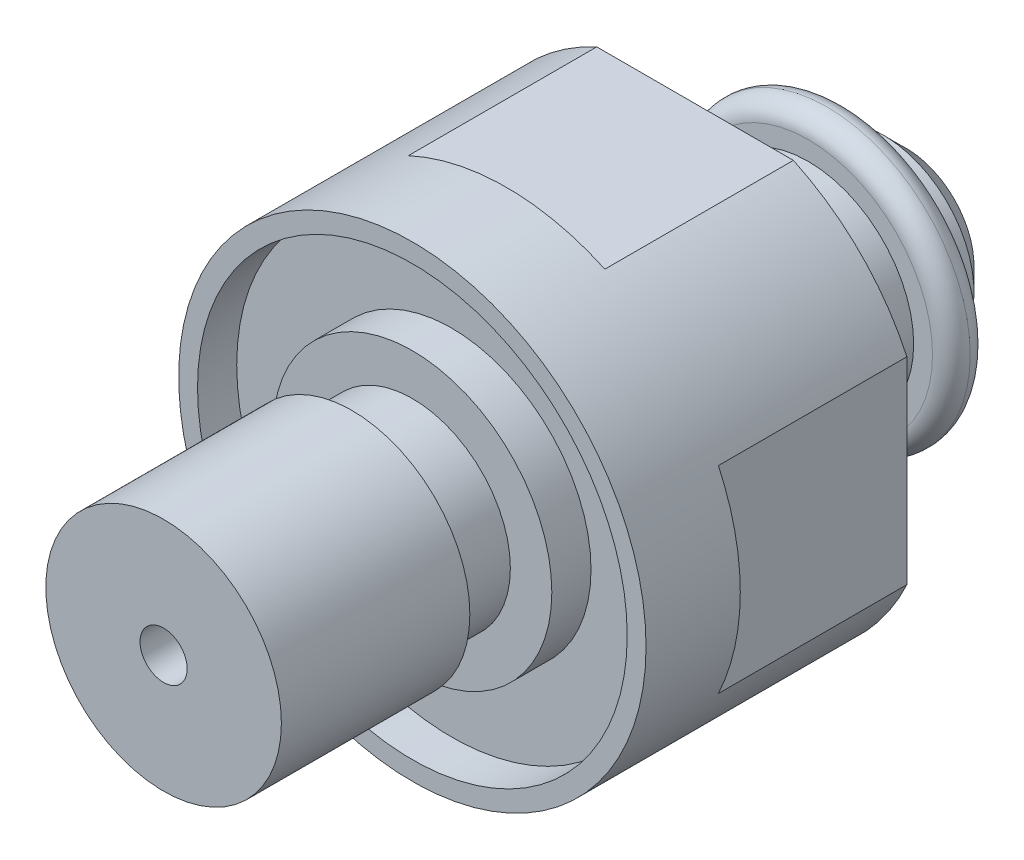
ISO-10303-21;
HEADER;
FILE_DESCRIPTION(('STEP AP214'),'2;1');
FILE_NAME('part.step','',(''),(''),'','','');
FILE_SCHEMA(('AUTOMOTIVE_DESIGN { 1 0 10303 214 1 1 1 1 }'));
ENDSEC;
DATA;
#1=APPLICATION_CONTEXT('core data for automotive mechanical design processes');
#2=APPLICATION_PROTOCOL_DEFINITION('international standard','automotive_design',2000,#1);
#3=PRODUCT_CONTEXT('',#1,'mechanical');
#4=PRODUCT('Part','Part','',(#3));
#5=PRODUCT_RELATED_PRODUCT_CATEGORY('part','',(#4));
#6=PRODUCT_DEFINITION_FORMATION('','',#4);
#7=PRODUCT_DEFINITION_CONTEXT('part definition',#1,'design');
#8=PRODUCT_DEFINITION('design','',#6,#7);
#9=PRODUCT_DEFINITION_SHAPE('','',#8);
#10=(LENGTH_UNIT() NAMED_UNIT(*) SI_UNIT(.MILLI.,.METRE.));
#11=(NAMED_UNIT(*) PLANE_ANGLE_UNIT() SI_UNIT($,.RADIAN.));
#12=(NAMED_UNIT(*) SI_UNIT($,.STERADIAN.) SOLID_ANGLE_UNIT());
#13=UNCERTAINTY_MEASURE_WITH_UNIT(LENGTH_MEASURE(1.E-05),#10,'distance_accuracy_value','');
#14=(GEOMETRIC_REPRESENTATION_CONTEXT(3) GLOBAL_UNCERTAINTY_ASSIGNED_CONTEXT((#13)) GLOBAL_UNIT_ASSIGNED_CONTEXT((#10,
#11,#12)) REPRESENTATION_CONTEXT('',''));
#15=CARTESIAN_POINT('',(0.,0.,0.));
#16=DIRECTION('',(0.,0.,1.));
#17=DIRECTION('',(1.,0.,0.));
#18=AXIS2_PLACEMENT_3D('',#15,#16,#17);
#19=CARTESIAN_POINT('',(0.,0.,-14.605));
#20=DIRECTION('',(0.,0.,-1.));
#21=DIRECTION('',(-1.,0.,0.));
#22=AXIS2_PLACEMENT_3D('',#19,#20,#21);
#23=PLANE('',#22);
#24=CARTESIAN_POINT('',(0.,0.,-14.605));
#25=DIRECTION('',(0.,0.,-1.));
#26=DIRECTION('',(-1.,0.,0.));
#27=AXIS2_PLACEMENT_3D('',#24,#25,#26);
#28=CIRCLE('',#27,4.191);
#29=CARTESIAN_POINT('',(-4.191,0.,-14.605));
#30=VERTEX_POINT('',#29);
#31=EDGE_CURVE('E437',#30,#30,#28,.T.);
#32=ORIENTED_EDGE('',*,*,#31,.T.);
#33=EDGE_LOOP('',(#32));
#34=FACE_BOUND('',#33,.T.);
#35=CARTESIAN_POINT('',(0.,0.,-14.605));
#36=DIRECTION('',(0.,0.,-1.));
#37=DIRECTION('',(-1.,0.,0.));
#38=AXIS2_PLACEMENT_3D('',#35,#36,#37);
#39=CIRCLE('',#38,3.048);
#40=CARTESIAN_POINT('',(-3.048,0.,-14.605));
#41=VERTEX_POINT('',#40);
#42=EDGE_CURVE('E169',#41,#41,#39,.T.);
#43=ORIENTED_EDGE('',*,*,#42,.F.);
#44=EDGE_LOOP('',(#43));
#45=FACE_BOUND('',#44,.T.);
#46=ADVANCED_FACE('F36',(#34,#45),#23,.T.);
#47=CARTESIAN_POINT('',(0.,0.,-9.525));
#48=DIRECTION('',(0.,0.,1.));
#49=DIRECTION('',(1.,0.,0.));
#50=AXIS2_PLACEMENT_3D('',#47,#48,#49);
#51=PLANE('',#50);
#52=CARTESIAN_POINT('',(0.,0.,-9.525));
#53=DIRECTION('',(0.,0.,1.));
#54=DIRECTION('',(1.,0.,0.));
#55=AXIS2_PLACEMENT_3D('',#52,#53,#54);
#56=CIRCLE('',#55,7.874);
#57=CARTESIAN_POINT('',(-7.1374,-3.32526649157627,-9.525));
#58=VERTEX_POINT('',#57);
#59=CARTESIAN_POINT('',(-3.31160262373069,-7.14375,-9.525));
#60=VERTEX_POINT('',#59);
#61=EDGE_CURVE('E114',#58,#60,#56,.T.);
#62=ORIENTED_EDGE('',*,*,#61,.F.);
#63=DIRECTION('',(0.,-1.,0.));
#64=VECTOR('',#63,1.);
#65=CARTESIAN_POINT('',(-7.1374,0.,-9.525));
#66=LINE('',#65,#64);
#67=CARTESIAN_POINT('',(-7.1374,3.32526649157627,-9.525));
#68=VERTEX_POINT('',#67);
#69=EDGE_CURVE('E101',#68,#58,#66,.T.);
#70=ORIENTED_EDGE('',*,*,#69,.F.);
#71=CARTESIAN_POINT('',(-3.31160262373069,7.14375,-9.525));
#72=VERTEX_POINT('',#71);
#73=EDGE_CURVE('E112',#72,#68,#56,.T.);
#74=ORIENTED_EDGE('',*,*,#73,.F.);
#75=DIRECTION('',(-1.,0.,0.));
#76=VECTOR('',#75,1.);
#77=CARTESIAN_POINT('',(10.16,7.14375,-9.525));
#78=LINE('',#77,#76);
#79=CARTESIAN_POINT('',(3.31160262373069,7.14375,-9.525));
#80=VERTEX_POINT('',#79);
#81=EDGE_CURVE('E183',#80,#72,#78,.T.);
#82=ORIENTED_EDGE('',*,*,#81,.F.);
#83=CARTESIAN_POINT('',(7.1374,3.32526649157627,-9.525));
#84=VERTEX_POINT('',#83);
#85=EDGE_CURVE('E127',#84,#80,#56,.T.);
#86=ORIENTED_EDGE('',*,*,#85,.F.);
#87=DIRECTION('',(0.,1.,0.));
#88=VECTOR('',#87,1.);
#89=CARTESIAN_POINT('',(7.1374,0.,-9.525));
#90=LINE('',#89,#88);
#91=CARTESIAN_POINT('',(7.1374,-3.32526649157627,-9.525));
#92=VERTEX_POINT('',#91);
#93=EDGE_CURVE('E190',#92,#84,#90,.T.);
#94=ORIENTED_EDGE('',*,*,#93,.F.);
#95=CARTESIAN_POINT('',(3.31160262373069,-7.14375,-9.525));
#96=VERTEX_POINT('',#95);
#97=EDGE_CURVE('E123',#96,#92,#56,.T.);
#98=ORIENTED_EDGE('',*,*,#97,.F.);
#99=DIRECTION('',(1.,0.,0.));
#100=VECTOR('',#99,1.);
#101=CARTESIAN_POINT('',(10.16,-7.14375,-9.525));
#102=LINE('',#101,#100);
#103=EDGE_CURVE('E187',#60,#96,#102,.T.);
#104=ORIENTED_EDGE('',*,*,#103,.F.);
#105=EDGE_LOOP('',(#62,#70,#74,#82,#86,#94,#98,#104));
#106=FACE_BOUND('',#105,.T.);
#107=CARTESIAN_POINT('',(0.,0.,-9.525));
#108=DIRECTION('',(0.,0.,1.));
#109=DIRECTION('',(1.,0.,0.));
#110=AXIS2_PLACEMENT_3D('',#107,#108,#109);
#111=CIRCLE('',#110,3.556);
#112=CARTESIAN_POINT('',(3.556,0.,-9.525));
#113=VERTEX_POINT('',#112);
#114=EDGE_CURVE('E121',#113,#113,#111,.F.);
#115=ORIENTED_EDGE('',*,*,#114,.F.);
#116=EDGE_LOOP('',(#115));
#117=FACE_BOUND('',#116,.T.);
#118=ADVANCED_FACE('F109',(#106,#117),#51,.F.);
#119=CARTESIAN_POINT('',(0.,0.,0.));
#120=DIRECTION('',(0.,0.,1.));
#121=DIRECTION('',(1.,0.,0.));
#122=AXIS2_PLACEMENT_3D('',#119,#120,#121);
#123=PLANE('',#122);
#124=CARTESIAN_POINT('',(0.,0.,0.));
#125=DIRECTION('',(0.,0.,1.));
#126=DIRECTION('',(1.,0.,0.));
#127=AXIS2_PLACEMENT_3D('',#124,#125,#126);
#128=CIRCLE('',#127,3.302);
#129=CARTESIAN_POINT('',(3.302,0.,0.));
#130=VERTEX_POINT('',#129);
#131=EDGE_CURVE('E143',#130,#130,#128,.T.);
#132=ORIENTED_EDGE('',*,*,#131,.F.);
#133=EDGE_LOOP('',(#132));
#134=FACE_BOUND('',#133,.T.);
#135=CARTESIAN_POINT('',(0.,0.,0.));
#136=DIRECTION('',(0.,0.,1.));
#137=DIRECTION('',(1.,0.,0.));
#138=AXIS2_PLACEMENT_3D('',#135,#136,#137);
#139=CIRCLE('',#138,4.699);
#140=CARTESIAN_POINT('',(4.699,0.,0.));
#141=VERTEX_POINT('',#140);
#142=EDGE_CURVE('E163',#141,#141,#139,.T.);
#143=ORIENTED_EDGE('',*,*,#142,.T.);
#144=EDGE_LOOP('',(#143));
#145=FACE_BOUND('',#144,.T.);
#146=ADVANCED_FACE('F234',(#134,#145),#123,.T.);
#147=CARTESIAN_POINT('',(0.,0.,2.032));
#148=DIRECTION('',(0.,0.,-1.));
#149=DIRECTION('',(-1.,0.,0.));
#150=AXIS2_PLACEMENT_3D('',#147,#148,#149);
#151=CYLINDRICAL_SURFACE('',#150,3.302);
#152=CARTESIAN_POINT('',(0.,0.,2.032));
#153=DIRECTION('',(0.,0.,1.));
#154=DIRECTION('',(1.,0.,0.));
#155=AXIS2_PLACEMENT_3D('',#152,#153,#154);
#156=CIRCLE('',#155,3.302);
#157=CARTESIAN_POINT('',(3.302,0.,2.032));
#158=VERTEX_POINT('',#157);
#159=EDGE_CURVE('E139',#158,#158,#156,.T.);
#160=ORIENTED_EDGE('',*,*,#159,.F.);
#161=EDGE_LOOP('',(#160));
#162=FACE_BOUND('',#161,.T.);
#163=ORIENTED_EDGE('',*,*,#131,.T.);
#164=EDGE_LOOP('',(#163));
#165=FACE_BOUND('',#164,.T.);
#166=ADVANCED_FACE('F263',(#162,#165),#151,.T.);
#167=CARTESIAN_POINT('',(0.,0.,2.032));
#168=DIRECTION('',(0.,0.,1.));
#169=DIRECTION('',(1.,0.,0.));
#170=AXIS2_PLACEMENT_3D('',#167,#168,#169);
#171=PLANE('',#170);
#172=CARTESIAN_POINT('',(0.,0.,2.032));
#173=DIRECTION('',(0.,0.,1.));
#174=DIRECTION('',(1.,0.,0.));
#175=AXIS2_PLACEMENT_3D('',#172,#173,#174);
#176=CIRCLE('',#175,3.96875);
#177=CARTESIAN_POINT('',(3.96875,0.,2.032));
#178=VERTEX_POINT('',#177);
#179=EDGE_CURVE('E151',#178,#178,#176,.T.);
#180=ORIENTED_EDGE('',*,*,#179,.F.);
#181=EDGE_LOOP('',(#180));
#182=FACE_BOUND('',#181,.T.);
#183=ORIENTED_EDGE('',*,*,#159,.T.);
#184=EDGE_LOOP('',(#183));
#185=FACE_BOUND('',#184,.T.);
#186=ADVANCED_FACE('F259',(#182,#185),#171,.F.);
#187=CARTESIAN_POINT('',(0.,0.,8.382));
#188=DIRECTION('',(0.,0.,-1.));
#189=DIRECTION('',(-1.,0.,0.));
#190=AXIS2_PLACEMENT_3D('',#187,#188,#189);
#191=CYLINDRICAL_SURFACE('',#190,3.96875);
#192=CARTESIAN_POINT('',(0.,0.,8.382));
#193=DIRECTION('',(0.,0.,1.));
#194=DIRECTION('',(1.,0.,0.));
#195=AXIS2_PLACEMENT_3D('',#192,#193,#194);
#196=CIRCLE('',#195,3.96875);
#197=CARTESIAN_POINT('',(3.96875,0.,8.382));
#198=VERTEX_POINT('',#197);
#199=EDGE_CURVE('E148',#198,#198,#196,.T.);
#200=ORIENTED_EDGE('',*,*,#199,.F.);
#201=EDGE_LOOP('',(#200));
#202=FACE_BOUND('',#201,.T.);
#203=ORIENTED_EDGE('',*,*,#179,.T.);
#204=EDGE_LOOP('',(#203));
#205=FACE_BOUND('',#204,.T.);
#206=ADVANCED_FACE('F262',(#202,#205),#191,.T.);
#207=CARTESIAN_POINT('',(0.,0.,8.382));
#208=DIRECTION('',(0.,0.,1.));
#209=DIRECTION('',(1.,0.,0.));
#210=AXIS2_PLACEMENT_3D('',#207,#208,#209);
#211=PLANE('',#210);
#212=CARTESIAN_POINT('',(0.,0.,8.382));
#213=DIRECTION('',(0.,0.,-1.));
#214=DIRECTION('',(-1.,0.,0.));
#215=AXIS2_PLACEMENT_3D('',#212,#213,#214);
#216=CIRCLE('',#215,0.79375);
#217=CARTESIAN_POINT('',(-0.79375,0.,8.382));
#218=VERTEX_POINT('',#217);
#219=EDGE_CURVE('E172',#218,#218,#216,.T.);
#220=ORIENTED_EDGE('',*,*,#219,.T.);
#221=EDGE_LOOP('',(#220));
#222=FACE_BOUND('',#221,.T.);
#223=ORIENTED_EDGE('',*,*,#199,.T.);
#224=EDGE_LOOP('',(#223));
#225=FACE_BOUND('',#224,.T.);
#226=ADVANCED_FACE('F257',(#222,#225),#211,.T.);
#227=CARTESIAN_POINT('',(0.,0.,-1.3208));
#228=DIRECTION('',(0.,0.,1.));
#229=DIRECTION('',(1.,0.,0.));
#230=AXIS2_PLACEMENT_3D('',#227,#228,#229);
#231=CYLINDRICAL_SURFACE('',#230,7.239);
#232=CARTESIAN_POINT('',(0.,0.,-1.3208));
#233=DIRECTION('',(0.,0.,1.));
#234=DIRECTION('',(1.,0.,0.));
#235=AXIS2_PLACEMENT_3D('',#232,#233,#234);
#236=CIRCLE('',#235,7.239);
#237=CARTESIAN_POINT('',(7.239,0.,-1.3208));
#238=VERTEX_POINT('',#237);
#239=EDGE_CURVE('E154',#238,#238,#236,.T.);
#240=ORIENTED_EDGE('',*,*,#239,.F.);
#241=EDGE_LOOP('',(#240));
#242=FACE_BOUND('',#241,.T.);
#243=CARTESIAN_POINT('',(0.,0.,0.));
#244=DIRECTION('',(0.,0.,1.));
#245=DIRECTION('',(1.,0.,0.));
#246=AXIS2_PLACEMENT_3D('',#243,#244,#245);
#247=CIRCLE('',#246,7.239);
#248=CARTESIAN_POINT('',(7.239,0.,0.));
#249=VERTEX_POINT('',#248);
#250=EDGE_CURVE('E157',#249,#249,#247,.T.);
#251=ORIENTED_EDGE('',*,*,#250,.T.);
#252=EDGE_LOOP('',(#251));
#253=FACE_BOUND('',#252,.T.);
#254=ADVANCED_FACE('F253',(#242,#253),#231,.F.);
#255=CARTESIAN_POINT('',(0.,0.,-1.3208));
#256=DIRECTION('',(0.,0.,1.));
#257=DIRECTION('',(1.,0.,0.));
#258=AXIS2_PLACEMENT_3D('',#255,#256,#257);
#259=PLANE('',#258);
#260=CARTESIAN_POINT('',(0.,0.,-1.3208));
#261=DIRECTION('',(0.,0.,1.));
#262=DIRECTION('',(1.,0.,0.));
#263=AXIS2_PLACEMENT_3D('',#260,#261,#262);
#264=CIRCLE('',#263,4.699);
#265=CARTESIAN_POINT('',(4.699,0.,-1.3208));
#266=VERTEX_POINT('',#265);
#267=EDGE_CURVE('E160',#266,#266,#264,.T.);
#268=ORIENTED_EDGE('',*,*,#267,.F.);
#269=EDGE_LOOP('',(#268));
#270=FACE_BOUND('',#269,.T.);
#271=ORIENTED_EDGE('',*,*,#239,.T.);
#272=EDGE_LOOP('',(#271));
#273=FACE_BOUND('',#272,.T.);
#274=ADVANCED_FACE('F249',(#270,#273),#259,.T.);
#275=CARTESIAN_POINT('',(0.,0.,-1.3208));
#276=DIRECTION('',(0.,0.,1.));
#277=DIRECTION('',(1.,0.,0.));
#278=AXIS2_PLACEMENT_3D('',#275,#276,#277);
#279=CYLINDRICAL_SURFACE('',#278,4.699);
#280=ORIENTED_EDGE('',*,*,#267,.T.);
#281=EDGE_LOOP('',(#280));
#282=FACE_BOUND('',#281,.T.);
#283=ORIENTED_EDGE('',*,*,#142,.F.);
#284=EDGE_LOOP('',(#283));
#285=FACE_BOUND('',#284,.T.);
#286=ADVANCED_FACE('F246',(#282,#285),#279,.T.);
#287=CARTESIAN_POINT('',(0.,0.,-9.525));
#288=DIRECTION('',(0.,0.,1.));
#289=DIRECTION('',(1.,0.,0.));
#290=AXIS2_PLACEMENT_3D('',#287,#288,#289);
#291=CYLINDRICAL_SURFACE('',#290,7.874);
#292=DIRECTION('',(0.,0.,1.));
#293=VECTOR('',#292,1.);
#294=CARTESIAN_POINT('',(-7.1374,3.32526649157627,-9.525));
#295=LINE('',#294,#293);
#296=CARTESIAN_POINT('',(-7.1374,3.32526649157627,-3.175));
#297=VERTEX_POINT('',#296);
#298=EDGE_CURVE('E11',#297,#68,#295,.F.);
#299=ORIENTED_EDGE('',*,*,#298,.F.);
#300=CARTESIAN_POINT('',(0.,0.,-3.175));
#301=DIRECTION('',(0.,0.,1.));
#302=DIRECTION('',(1.,0.,0.));
#303=AXIS2_PLACEMENT_3D('',#300,#301,#302);
#304=CIRCLE('',#303,7.874);
#305=CARTESIAN_POINT('',(-7.1374,-3.32526649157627,-3.175));
#306=VERTEX_POINT('',#305);
#307=EDGE_CURVE('E219',#306,#297,#304,.F.);
#308=ORIENTED_EDGE('',*,*,#307,.F.);
#309=DIRECTION('',(0.,0.,1.));
#310=VECTOR('',#309,1.);
#311=CARTESIAN_POINT('',(-7.1374,-3.32526649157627,-9.525));
#312=LINE('',#311,#310);
#313=EDGE_CURVE('E44',#58,#306,#312,.T.);
#314=ORIENTED_EDGE('',*,*,#313,.F.);
#315=ORIENTED_EDGE('',*,*,#61,.T.);
#316=DIRECTION('',(0.,0.,1.));
#317=VECTOR('',#316,1.);
#318=CARTESIAN_POINT('',(-3.31160262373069,-7.14375,-9.525));
#319=LINE('',#318,#317);
#320=CARTESIAN_POINT('',(-3.31160262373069,-7.14375,-3.175));
#321=VERTEX_POINT('',#320);
#322=EDGE_CURVE('E214',#321,#60,#319,.F.);
#323=ORIENTED_EDGE('',*,*,#322,.F.);
#324=CARTESIAN_POINT('',(0.,0.,-3.175));
#325=DIRECTION('',(0.,0.,1.));
#326=DIRECTION('',(1.,0.,0.));
#327=AXIS2_PLACEMENT_3D('',#324,#325,#326);
#328=CIRCLE('',#327,7.874);
#329=CARTESIAN_POINT('',(3.31160262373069,-7.14375,-3.175));
#330=VERTEX_POINT('',#329);
#331=EDGE_CURVE('E204',#330,#321,#328,.F.);
#332=ORIENTED_EDGE('',*,*,#331,.F.);
#333=DIRECTION('',(0.,0.,1.));
#334=VECTOR('',#333,1.);
#335=CARTESIAN_POINT('',(3.31160262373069,-7.14375,-9.525));
#336=LINE('',#335,#334);
#337=EDGE_CURVE('E206',#96,#330,#336,.T.);
#338=ORIENTED_EDGE('',*,*,#337,.F.);
#339=ORIENTED_EDGE('',*,*,#97,.T.);
#340=DIRECTION('',(0.,0.,1.));
#341=VECTOR('',#340,1.);
#342=CARTESIAN_POINT('',(7.1374,-3.32526649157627,-9.525));
#343=LINE('',#342,#341);
#344=CARTESIAN_POINT('',(7.1374,-3.32526649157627,-3.175));
#345=VERTEX_POINT('',#344);
#346=EDGE_CURVE('E197',#345,#92,#343,.F.);
#347=ORIENTED_EDGE('',*,*,#346,.F.);
#348=CARTESIAN_POINT('',(0.,0.,-3.175));
#349=DIRECTION('',(0.,0.,-1.));
#350=DIRECTION('',(-1.,0.,0.));
#351=AXIS2_PLACEMENT_3D('',#348,#349,#350);
#352=CIRCLE('',#351,7.874);
#353=CARTESIAN_POINT('',(7.1374,3.32526649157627,-3.175));
#354=VERTEX_POINT('',#353);
#355=EDGE_CURVE('E198',#345,#354,#352,.F.);
#356=ORIENTED_EDGE('',*,*,#355,.T.);
#357=DIRECTION('',(0.,0.,1.));
#358=VECTOR('',#357,1.);
#359=CARTESIAN_POINT('',(7.1374,3.32526649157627,-9.525));
#360=LINE('',#359,#358);
#361=EDGE_CURVE('E195',#84,#354,#360,.T.);
#362=ORIENTED_EDGE('',*,*,#361,.F.);
#363=ORIENTED_EDGE('',*,*,#85,.T.);
#364=DIRECTION('',(0.,0.,1.));
#365=VECTOR('',#364,1.);
#366=CARTESIAN_POINT('',(3.31160262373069,7.14375,-9.525));
#367=LINE('',#366,#365);
#368=CARTESIAN_POINT('',(3.31160262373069,7.14375,-3.175));
#369=VERTEX_POINT('',#368);
#370=EDGE_CURVE('E203',#369,#80,#367,.F.);
#371=ORIENTED_EDGE('',*,*,#370,.F.);
#372=CARTESIAN_POINT('',(0.,0.,-3.175));
#373=DIRECTION('',(0.,0.,-1.));
#374=DIRECTION('',(-1.,0.,0.));
#375=AXIS2_PLACEMENT_3D('',#372,#373,#374);
#376=CIRCLE('',#375,7.874);
#377=CARTESIAN_POINT('',(-3.31160262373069,7.14375,-3.175));
#378=VERTEX_POINT('',#377);
#379=EDGE_CURVE('E208',#369,#378,#376,.F.);
#380=ORIENTED_EDGE('',*,*,#379,.T.);
#381=DIRECTION('',(0.,0.,1.));
#382=VECTOR('',#381,1.);
#383=CARTESIAN_POINT('',(-3.31160262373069,7.14375,-9.525));
#384=LINE('',#383,#382);
#385=EDGE_CURVE('E120',#72,#378,#384,.T.);
#386=ORIENTED_EDGE('',*,*,#385,.F.);
#387=ORIENTED_EDGE('',*,*,#73,.T.);
#388=EDGE_LOOP('',(#299,#308,#314,#315,#323,#332,#338,#339,#347,#356,#362,#363,#371,#380,#386,#387));
#389=FACE_BOUND('',#388,.T.);
#390=CARTESIAN_POINT('',(0.,0.,0.));
#391=DIRECTION('',(0.,0.,1.));
#392=DIRECTION('',(1.,0.,0.));
#393=AXIS2_PLACEMENT_3D('',#390,#391,#392);
#394=CIRCLE('',#393,7.874);
#395=CARTESIAN_POINT('',(7.874,0.,0.));
#396=VERTEX_POINT('',#395);
#397=EDGE_CURVE('E133',#396,#396,#394,.T.);
#398=ORIENTED_EDGE('',*,*,#397,.F.);
#399=EDGE_LOOP('',(#398));
#400=FACE_BOUND('',#399,.T.);
#401=ADVANCED_FACE('F38',(#389,#400),#291,.T.);
#402=ORIENTED_EDGE('',*,*,#250,.F.);
#403=EDGE_LOOP('',(#402));
#404=FACE_BOUND('',#403,.T.);
#405=ORIENTED_EDGE('',*,*,#397,.T.);
#406=EDGE_LOOP('',(#405));
#407=FACE_BOUND('',#406,.T.);
#408=ADVANCED_FACE('F244',(#404,#407),#123,.T.);
#409=CARTESIAN_POINT('',(0.,0.,-13.335));
#410=DIRECTION('',(0.,0.,1.));
#411=DIRECTION('',(1.,0.,0.));
#412=AXIS2_PLACEMENT_3D('',#409,#410,#411);
#413=CYLINDRICAL_SURFACE('',#412,3.556);
#414=CARTESIAN_POINT('',(0.,0.,-13.335));
#415=DIRECTION('',(0.,0.,-1.));
#416=DIRECTION('',(-1.,0.,0.));
#417=AXIS2_PLACEMENT_3D('',#414,#415,#416);
#418=CIRCLE('',#417,3.556);
#419=CARTESIAN_POINT('',(3.556,0.,-13.335));
#420=VERTEX_POINT('',#419);
#421=EDGE_CURVE('E166',#420,#420,#418,.T.);
#422=CARTESIAN_POINT('',(3.556,0.,-13.335));
#423=CARTESIAN_POINT('',(3.556,0.,-13.2953125));
#424=CARTESIAN_POINT('',(3.556,0.,-13.255625));
#425=CARTESIAN_POINT('',(3.556,0.,-13.17625));
#426=CARTESIAN_POINT('',(3.556,0.,-13.1365625));
#427=CARTESIAN_POINT('',(3.556,0.,-13.0571875));
#428=CARTESIAN_POINT('',(3.556,0.,-13.0175));
#429=CARTESIAN_POINT('',(3.556,0.,-12.938125));
#430=CARTESIAN_POINT('',(3.556,0.,-12.8984375));
#431=CARTESIAN_POINT('',(3.556,0.,-12.8190625));
#432=CARTESIAN_POINT('',(3.556,0.,-12.779375));
#433=CARTESIAN_POINT('',(3.556,0.,-12.7));
#434=CARTESIAN_POINT('',(3.556,0.,-12.6603125));
#435=CARTESIAN_POINT('',(3.556,0.,-12.5809375));
#436=CARTESIAN_POINT('',(3.556,0.,-12.54125));
#437=CARTESIAN_POINT('',(3.556,0.,-12.461875));
#438=CARTESIAN_POINT('',(3.556,0.,-12.4221875));
#439=CARTESIAN_POINT('',(3.556,0.,-12.3428125));
#440=CARTESIAN_POINT('',(3.556,0.,-12.303125));
#441=CARTESIAN_POINT('',(3.556,0.,-12.22375));
#442=CARTESIAN_POINT('',(3.556,0.,-12.1840625));
#443=CARTESIAN_POINT('',(3.556,0.,-12.1046875));
#444=CARTESIAN_POINT('',(3.556,0.,-12.065));
#445=CARTESIAN_POINT('',(3.556,0.,-11.985625));
#446=CARTESIAN_POINT('',(3.556,0.,-11.9459375));
#447=CARTESIAN_POINT('',(3.556,0.,-11.8665625));
#448=CARTESIAN_POINT('',(3.556,0.,-11.826875));
#449=CARTESIAN_POINT('',(3.556,0.,-11.7475));
#450=CARTESIAN_POINT('',(3.556,0.,-11.7078125));
#451=CARTESIAN_POINT('',(3.556,0.,-11.6284375));
#452=CARTESIAN_POINT('',(3.556,0.,-11.58875));
#453=CARTESIAN_POINT('',(3.556,0.,-11.509375));
#454=CARTESIAN_POINT('',(3.556,0.,-11.4696875));
#455=CARTESIAN_POINT('',(3.556,0.,-11.3903125));
#456=CARTESIAN_POINT('',(3.556,0.,-11.350625));
#457=CARTESIAN_POINT('',(3.556,0.,-11.27125));
#458=CARTESIAN_POINT('',(3.556,0.,-11.2315625));
#459=CARTESIAN_POINT('',(3.556,0.,-11.1521875));
#460=CARTESIAN_POINT('',(3.556,0.,-11.1125));
#461=CARTESIAN_POINT('',(3.556,0.,-11.033125));
#462=CARTESIAN_POINT('',(3.556,0.,-10.9934375));
#463=CARTESIAN_POINT('',(3.556,0.,-10.9140625));
#464=CARTESIAN_POINT('',(3.556,0.,-10.874375));
#465=CARTESIAN_POINT('',(3.556,0.,-10.795));
#466=CARTESIAN_POINT('',(3.556,0.,-10.7553125));
#467=CARTESIAN_POINT('',(3.556,0.,-10.6759375));
#468=CARTESIAN_POINT('',(3.556,0.,-10.63625));
#469=CARTESIAN_POINT('',(3.556,0.,-10.556875));
#470=CARTESIAN_POINT('',(3.556,0.,-10.5171875));
#471=CARTESIAN_POINT('',(3.556,0.,-10.4378125));
#472=CARTESIAN_POINT('',(3.556,0.,-10.398125));
#473=CARTESIAN_POINT('',(3.556,0.,-10.31875));
#474=CARTESIAN_POINT('',(3.556,0.,-10.2790625));
#475=CARTESIAN_POINT('',(3.556,0.,-10.1996875));
#476=CARTESIAN_POINT('',(3.556,0.,-10.16));
#477=CARTESIAN_POINT('',(3.556,0.,-10.080625));
#478=CARTESIAN_POINT('',(3.556,0.,-10.0409375));
#479=CARTESIAN_POINT('',(3.556,0.,-9.9615625));
#480=CARTESIAN_POINT('',(3.556,0.,-9.921875));
#481=CARTESIAN_POINT('',(3.556,0.,-9.8425));
#482=CARTESIAN_POINT('',(3.556,0.,-9.8028125));
#483=CARTESIAN_POINT('',(3.556,0.,-9.7234375));
#484=CARTESIAN_POINT('',(3.556,0.,-9.68375));
#485=CARTESIAN_POINT('',(3.556,0.,-9.604375));
#486=CARTESIAN_POINT('',(3.556,0.,-9.5646875));
#487=CARTESIAN_POINT('',(3.556,0.,-9.525));
#488=B_SPLINE_CURVE_WITH_KNOTS('',3,(#422,#423,#424,#425,#426,#427,#428,#429,#430,#431,#432,
#433,#434,#435,#436,#437,#438,#439,#440,#441,#442,#443,#444,#445,#446,#447,#448,#449,#450,#451,
#452,#453,#454,#455,#456,#457,#458,#459,#460,#461,#462,#463,#464,#465,#466,#467,#468,#469,#470,
#471,#472,#473,#474,#475,#476,#477,#478,#479,#480,#481,#482,#483,#484,#485,#486,#487),
.UNSPECIFIED.,.F.,.F.,(4,2,2,2,2,2,2,2,2,2,2,2,2,2,2,2,2,2,2,2,2,2,2,2,2,2,2,2,2,2,2,2,4),(0.,
0.119062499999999,0.238124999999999,0.357187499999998,0.476249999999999,0.595312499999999,
0.714374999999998,0.833437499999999,0.952499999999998,1.0715625,1.190625,1.3096875,1.42875,
1.5478125,1.666875,1.7859375,1.905,2.0240625,2.143125,2.2621875,2.38125,2.5003125,2.619375,
2.7384375,2.8575,2.9765625,3.095625,3.2146875,3.33375,3.4528125,3.571875,3.6909375,3.81),.UNSPECIFIED.);
#489=EDGE_CURVE('BSEAM241',#420,#113,#488,.T.);
#490=ORIENTED_EDGE('',*,*,#421,.F.);
#491=ORIENTED_EDGE('',*,*,#114,.T.);
#492=ORIENTED_EDGE('',*,*,#489,.T.);
#493=ORIENTED_EDGE('',*,*,#489,.F.);
#494=EDGE_LOOP('',(#490,#492,#491,#493));
#495=FACE_BOUND('',#494,.T.);
#496=ADVANCED_FACE('F241',(#495),#413,.T.);
#497=CARTESIAN_POINT('',(0.,0.,-13.335));
#498=DIRECTION('',(0.,0.,-1.));
#499=DIRECTION('',(-1.,0.,0.));
#500=AXIS2_PLACEMENT_3D('',#497,#498,#499);
#501=PLANE('',#500);
#502=CARTESIAN_POINT('',(0.,0.,-13.335));
#503=DIRECTION('',(0.,0.,-1.));
#504=DIRECTION('',(-1.,0.,0.));
#505=AXIS2_PLACEMENT_3D('',#502,#503,#504);
#506=CIRCLE('',#505,4.191);
#507=CARTESIAN_POINT('',(-4.191,0.,-13.335));
#508=VERTEX_POINT('',#507);
#509=EDGE_CURVE('E125',#508,#508,#506,.F.);
#510=ORIENTED_EDGE('',*,*,#509,.T.);
#511=EDGE_LOOP('',(#510));
#512=FACE_BOUND('',#511,.T.);
#513=ORIENTED_EDGE('',*,*,#421,.T.);
#514=EDGE_LOOP('',(#513));
#515=FACE_BOUND('',#514,.T.);
#516=ADVANCED_FACE('F239',(#512,#515),#501,.F.);
#517=CARTESIAN_POINT('',(0.,0.,-16.637));
#518=DIRECTION('',(0.,0.,1.));
#519=DIRECTION('',(1.,0.,0.));
#520=AXIS2_PLACEMENT_3D('',#517,#518,#519);
#521=CYLINDRICAL_SURFACE('',#520,3.048);
#522=CARTESIAN_POINT('',(0.,0.,-15.875));
#523=DIRECTION('',(0.,0.,-1.));
#524=DIRECTION('',(-1.,0.,0.));
#525=AXIS2_PLACEMENT_3D('',#522,#523,#524);
#526=CIRCLE('',#525,3.048);
#527=CARTESIAN_POINT('',(-3.048,0.,-15.875));
#528=VERTEX_POINT('',#527);
#529=EDGE_CURVE('E432',#528,#528,#526,.F.);
#530=ORIENTED_EDGE('',*,*,#529,.T.);
#531=EDGE_LOOP('',(#530));
#532=FACE_BOUND('',#531,.T.);
#533=ORIENTED_EDGE('',*,*,#42,.T.);
#534=EDGE_LOOP('',(#533));
#535=FACE_BOUND('',#534,.T.);
#536=ADVANCED_FACE('F421',(#532,#535),#521,.T.);
#537=CARTESIAN_POINT('',(0.,0.,-16.637));
#538=DIRECTION('',(0.,0.,-1.));
#539=DIRECTION('',(-1.,0.,0.));
#540=AXIS2_PLACEMENT_3D('',#537,#538,#539);
#541=PLANE('',#540);
#542=CARTESIAN_POINT('',(0.,0.,-16.637));
#543=DIRECTION('',(0.,0.,-1.));
#544=DIRECTION('',(-1.,0.,0.));
#545=AXIS2_PLACEMENT_3D('',#542,#543,#544);
#546=CIRCLE('',#545,2.286);
#547=CARTESIAN_POINT('',(-2.286,0.,-16.637));
#548=VERTEX_POINT('',#547);
#549=EDGE_CURVE('E434',#548,#548,#546,.T.);
#550=ORIENTED_EDGE('',*,*,#549,.T.);
#551=EDGE_LOOP('',(#550));
#552=FACE_BOUND('',#551,.T.);
#553=CARTESIAN_POINT('',(0.,0.,-16.637));
#554=DIRECTION('',(0.,0.,-1.));
#555=DIRECTION('',(-1.,0.,0.));
#556=AXIS2_PLACEMENT_3D('',#553,#554,#555);
#557=CIRCLE('',#556,0.79375);
#558=CARTESIAN_POINT('',(-0.79375,0.,-16.637));
#559=VERTEX_POINT('',#558);
#560=EDGE_CURVE('E175',#559,#559,#557,.T.);
#561=ORIENTED_EDGE('',*,*,#560,.F.);
#562=EDGE_LOOP('',(#561));
#563=FACE_BOUND('',#562,.T.);
#564=ADVANCED_FACE('F418',(#552,#563),#541,.T.);
#565=CARTESIAN_POINT('',(0.,0.,8.382));
#566=DIRECTION('',(0.,0.,-1.));
#567=DIRECTION('',(-1.,0.,0.));
#568=AXIS2_PLACEMENT_3D('',#565,#566,#567);
#569=CYLINDRICAL_SURFACE('',#568,0.79375);
#570=ORIENTED_EDGE('',*,*,#219,.F.);
#571=EDGE_LOOP('',(#570));
#572=FACE_BOUND('',#571,.T.);
#573=ORIENTED_EDGE('',*,*,#560,.T.);
#574=EDGE_LOOP('',(#573));
#575=FACE_BOUND('',#574,.T.);
#576=ADVANCED_FACE('F414',(#572,#575),#569,.F.);
#577=CARTESIAN_POINT('',(0.,0.,-13.97));
#578=DIRECTION('',(0.,0.,-1.));
#579=DIRECTION('',(-1.,0.,0.));
#580=AXIS2_PLACEMENT_3D('',#577,#578,#579);
#581=TOROIDAL_SURFACE('',#580,4.191,0.635);
#582=ORIENTED_EDGE('',*,*,#31,.F.);
#583=EDGE_LOOP('',(#582));
#584=FACE_BOUND('',#583,.T.);
#585=CARTESIAN_POINT('',(0.,0.,-13.97));
#586=DIRECTION('',(0.,0.,-1.));
#587=DIRECTION('',(-1.,0.,0.));
#588=AXIS2_PLACEMENT_3D('',#585,#586,#587);
#589=CIRCLE('',#588,4.826);
#590=CARTESIAN_POINT('',(-4.826,0.,-13.97));
#591=VERTEX_POINT('',#590);
#592=EDGE_CURVE('E178',#591,#591,#589,.F.);
#593=ORIENTED_EDGE('',*,*,#592,.F.);
#594=EDGE_LOOP('',(#593));
#595=FACE_BOUND('',#594,.T.);
#596=ADVANCED_FACE('F410',(#584,#595),#581,.T.);
#597=CARTESIAN_POINT('',(0.,0.,-13.97));
#598=DIRECTION('',(0.,0.,-1.));
#599=DIRECTION('',(-1.,0.,0.));
#600=AXIS2_PLACEMENT_3D('',#597,#598,#599);
#601=TOROIDAL_SURFACE('',#600,4.191,0.635);
#602=ORIENTED_EDGE('',*,*,#509,.F.);
#603=EDGE_LOOP('',(#602));
#604=FACE_BOUND('',#603,.T.);
#605=ORIENTED_EDGE('',*,*,#592,.T.);
#606=EDGE_LOOP('',(#605));
#607=FACE_BOUND('',#606,.T.);
#608=ADVANCED_FACE('F406',(#604,#607),#601,.T.);
#609=CARTESIAN_POINT('',(0.,0.,-16.637));
#610=DIRECTION('',(0.,0.,1.));
#611=DIRECTION('',(1.,0.,0.));
#612=AXIS2_PLACEMENT_3D('',#609,#610,#611);
#613=CONICAL_SURFACE('',#612,2.286,0.785398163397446);
#614=ORIENTED_EDGE('',*,*,#529,.F.);
#615=EDGE_LOOP('',(#614));
#616=FACE_BOUND('',#615,.T.);
#617=ORIENTED_EDGE('',*,*,#549,.F.);
#618=EDGE_LOOP('',(#617));
#619=FACE_BOUND('',#618,.T.);
#620=ADVANCED_FACE('F339',(#616,#619),#613,.T.);
#621=CARTESIAN_POINT('',(10.16,7.14375,-3.175));
#622=DIRECTION('',(0.,-1.,0.));
#623=DIRECTION('',(0.,0.,-1.));
#624=AXIS2_PLACEMENT_3D('',#621,#622,#623);
#625=PLANE('',#624);
#626=ORIENTED_EDGE('',*,*,#370,.T.);
#627=ORIENTED_EDGE('',*,*,#81,.T.);
#628=ORIENTED_EDGE('',*,*,#385,.T.);
#629=DIRECTION('',(-1.,0.,0.));
#630=VECTOR('',#629,1.);
#631=CARTESIAN_POINT('',(10.16,7.14375,-3.175));
#632=LINE('',#631,#630);
#633=EDGE_CURVE('E181',#369,#378,#632,.T.);
#634=ORIENTED_EDGE('',*,*,#633,.F.);
#635=EDGE_LOOP('',(#626,#627,#628,#634));
#636=FACE_BOUND('',#635,.T.);
#637=ADVANCED_FACE('F201',(#636),#625,.F.);
#638=CARTESIAN_POINT('',(-10.16,10.16,-3.175));
#639=DIRECTION('',(0.,0.,-1.));
#640=DIRECTION('',(-1.,0.,0.));
#641=AXIS2_PLACEMENT_3D('',#638,#639,#640);
#642=PLANE('',#641);
#643=ORIENTED_EDGE('',*,*,#633,.T.);
#644=ORIENTED_EDGE('',*,*,#379,.F.);
#645=EDGE_LOOP('',(#643,#644));
#646=FACE_BOUND('',#645,.T.);
#647=ADVANCED_FACE('F338',(#646),#642,.T.);
#648=CARTESIAN_POINT('',(10.16,-7.14375,-3.175));
#649=DIRECTION('',(0.,1.,0.));
#650=DIRECTION('',(0.,0.,1.));
#651=AXIS2_PLACEMENT_3D('',#648,#649,#650);
#652=PLANE('',#651);
#653=ORIENTED_EDGE('',*,*,#322,.T.);
#654=ORIENTED_EDGE('',*,*,#103,.T.);
#655=ORIENTED_EDGE('',*,*,#337,.T.);
#656=DIRECTION('',(1.,0.,0.));
#657=VECTOR('',#656,1.);
#658=CARTESIAN_POINT('',(10.16,-7.14375,-3.175));
#659=LINE('',#658,#657);
#660=EDGE_CURVE('E185',#321,#330,#659,.T.);
#661=ORIENTED_EDGE('',*,*,#660,.F.);
#662=EDGE_LOOP('',(#653,#654,#655,#661));
#663=FACE_BOUND('',#662,.T.);
#664=ADVANCED_FACE('F350',(#663),#652,.F.);
#665=CARTESIAN_POINT('',(-10.16,-7.14375,-3.175));
#666=DIRECTION('',(0.,0.,1.));
#667=DIRECTION('',(1.,0.,0.));
#668=AXIS2_PLACEMENT_3D('',#665,#666,#667);
#669=PLANE('',#668);
#670=ORIENTED_EDGE('',*,*,#331,.T.);
#671=ORIENTED_EDGE('',*,*,#660,.T.);
#672=EDGE_LOOP('',(#670,#671));
#673=FACE_BOUND('',#672,.T.);
#674=ADVANCED_FACE('F360',(#673),#669,.F.);
#675=CARTESIAN_POINT('',(7.1374,0.,-3.175));
#676=DIRECTION('',(-1.,0.,0.));
#677=DIRECTION('',(0.,0.,1.));
#678=AXIS2_PLACEMENT_3D('',#675,#676,#677);
#679=PLANE('',#678);
#680=ORIENTED_EDGE('',*,*,#346,.T.);
#681=ORIENTED_EDGE('',*,*,#93,.T.);
#682=ORIENTED_EDGE('',*,*,#361,.T.);
#683=DIRECTION('',(0.,1.,0.));
#684=VECTOR('',#683,1.);
#685=CARTESIAN_POINT('',(7.1374,-5.01792728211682,-3.175));
#686=LINE('',#685,#684);
#687=EDGE_CURVE('E57',#345,#354,#686,.T.);
#688=ORIENTED_EDGE('',*,*,#687,.F.);
#689=EDGE_LOOP('',(#680,#681,#682,#688));
#690=FACE_BOUND('',#689,.T.);
#691=ADVANCED_FACE('F194',(#690),#679,.F.);
#692=CARTESIAN_POINT('',(7.1374,-5.01792728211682,-3.175));
#693=DIRECTION('',(0.,0.,-1.));
#694=DIRECTION('',(-1.,0.,0.));
#695=AXIS2_PLACEMENT_3D('',#692,#693,#694);
#696=PLANE('',#695);
#697=ORIENTED_EDGE('',*,*,#687,.T.);
#698=ORIENTED_EDGE('',*,*,#355,.F.);
#699=EDGE_LOOP('',(#697,#698));
#700=FACE_BOUND('',#699,.T.);
#701=ADVANCED_FACE('F226',(#700),#696,.T.);
#702=CARTESIAN_POINT('',(-7.1374,0.,-3.175));
#703=DIRECTION('',(1.,0.,0.));
#704=DIRECTION('',(0.,0.,-1.));
#705=AXIS2_PLACEMENT_3D('',#702,#703,#704);
#706=PLANE('',#705);
#707=ORIENTED_EDGE('',*,*,#298,.T.);
#708=ORIENTED_EDGE('',*,*,#69,.T.);
#709=ORIENTED_EDGE('',*,*,#313,.T.);
#710=DIRECTION('',(0.,-1.,0.));
#711=VECTOR('',#710,1.);
#712=CARTESIAN_POINT('',(-7.1374,-5.01792728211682,-3.175));
#713=LINE('',#712,#711);
#714=EDGE_CURVE('E50',#297,#306,#713,.T.);
#715=ORIENTED_EDGE('',*,*,#714,.F.);
#716=EDGE_LOOP('',(#707,#708,#709,#715));
#717=FACE_BOUND('',#716,.T.);
#718=ADVANCED_FACE('F100',(#717),#706,.F.);
#719=CARTESIAN_POINT('',(-7.1374,4.84187500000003,-3.175));
#720=DIRECTION('',(0.,0.,1.));
#721=DIRECTION('',(1.,0.,0.));
#722=AXIS2_PLACEMENT_3D('',#719,#720,#721);
#723=PLANE('',#722);
#724=ORIENTED_EDGE('',*,*,#307,.T.);
#725=ORIENTED_EDGE('',*,*,#714,.T.);
#726=EDGE_LOOP('',(#724,#725));
#727=FACE_BOUND('',#726,.T.);
#728=ADVANCED_FACE('F220',(#727),#723,.F.);
#729=CLOSED_SHELL('',(#46,#118,#146,#166,#186,#206,#226,#254,#274,#286,#401,#408,#496,#516,#536,
#564,#576,#596,#608,#620,#637,#647,#664,#674,#691,#701,#718,#728));
#730=MANIFOLD_SOLID_BREP('B2',#729);
#731=ADVANCED_BREP_SHAPE_REPRESENTATION('',(#18,#730),#14);
#732=SHAPE_DEFINITION_REPRESENTATION(#9,#731);
ENDSEC;
END-ISO-10303-21;
